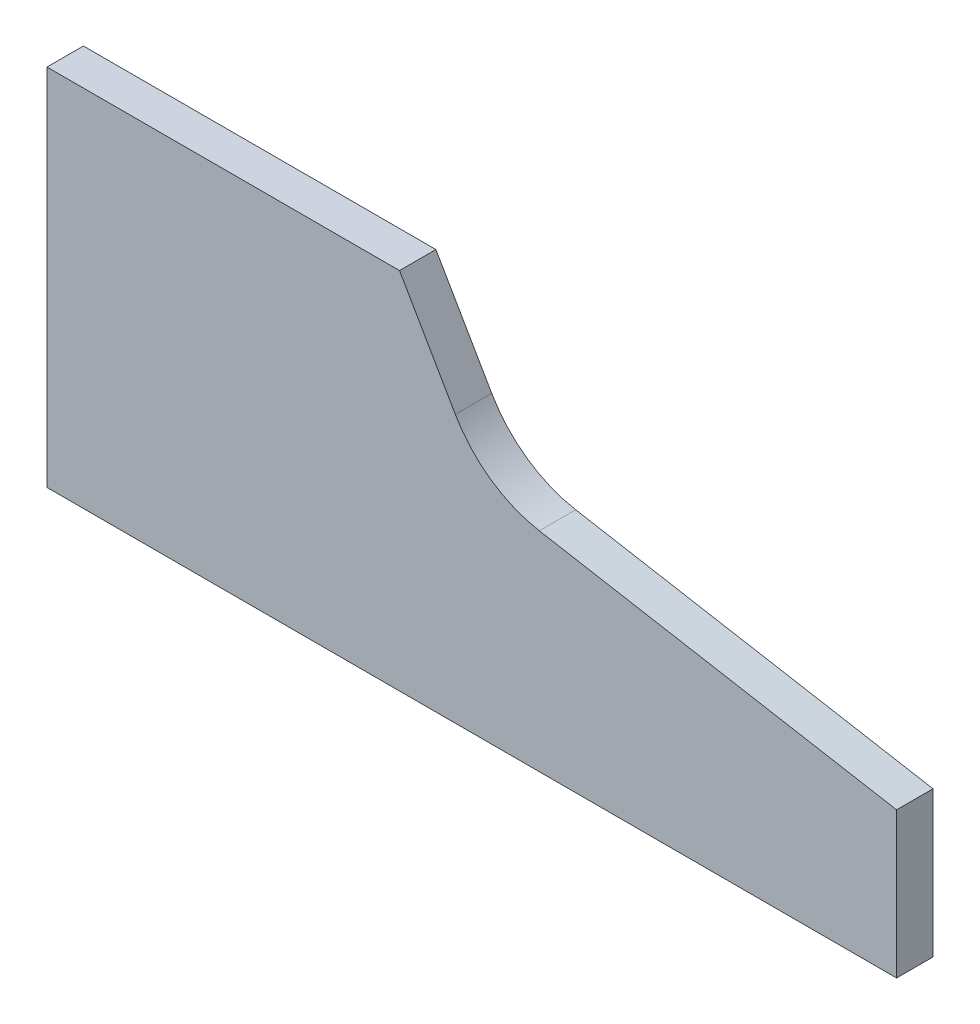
ISO-10303-21;
HEADER;
FILE_DESCRIPTION(('STEP AP214'),'2;1');
FILE_NAME('part.step','',(''),(''),'','','');
FILE_SCHEMA(('AUTOMOTIVE_DESIGN { 1 0 10303 214 1 1 1 1 }'));
ENDSEC;
DATA;
#1=APPLICATION_CONTEXT('core data for automotive mechanical design processes');
#2=APPLICATION_PROTOCOL_DEFINITION('international standard','automotive_design',2000,#1);
#3=PRODUCT_CONTEXT('',#1,'mechanical');
#4=PRODUCT('Part','Part','',(#3));
#5=PRODUCT_RELATED_PRODUCT_CATEGORY('part','',(#4));
#6=PRODUCT_DEFINITION_FORMATION('','',#4);
#7=PRODUCT_DEFINITION_CONTEXT('part definition',#1,'design');
#8=PRODUCT_DEFINITION('design','',#6,#7);
#9=PRODUCT_DEFINITION_SHAPE('','',#8);
#10=(LENGTH_UNIT() NAMED_UNIT(*) SI_UNIT(.MILLI.,.METRE.));
#11=(NAMED_UNIT(*) PLANE_ANGLE_UNIT() SI_UNIT($,.RADIAN.));
#12=(NAMED_UNIT(*) SI_UNIT($,.STERADIAN.) SOLID_ANGLE_UNIT());
#13=UNCERTAINTY_MEASURE_WITH_UNIT(LENGTH_MEASURE(1.E-05),#10,'distance_accuracy_value','');
#14=(GEOMETRIC_REPRESENTATION_CONTEXT(3) GLOBAL_UNCERTAINTY_ASSIGNED_CONTEXT((#13)) GLOBAL_UNIT_ASSIGNED_CONTEXT((#10,
#11,#12)) REPRESENTATION_CONTEXT('',''));
#15=CARTESIAN_POINT('',(0.,0.,0.));
#16=DIRECTION('',(0.,0.,1.));
#17=DIRECTION('',(1.,0.,0.));
#18=AXIS2_PLACEMENT_3D('',#15,#16,#17);
#19=CARTESIAN_POINT('',(70.,0.,1.5));
#20=DIRECTION('',(0.,1.,0.));
#21=DIRECTION('',(-1.,0.,0.));
#22=AXIS2_PLACEMENT_3D('',#19,#20,#21);
#23=PLANE('',#22);
#24=DIRECTION('',(1.,0.,0.));
#25=VECTOR('',#24,1.);
#26=CARTESIAN_POINT('',(70.,0.,-1.5));
#27=LINE('',#26,#25);
#28=CARTESIAN_POINT('',(0.,0.,-1.5));
#29=VERTEX_POINT('',#28);
#30=CARTESIAN_POINT('',(70.,0.,-1.5));
#31=VERTEX_POINT('',#30);
#32=EDGE_CURVE('E123',#29,#31,#27,.T.);
#33=ORIENTED_EDGE('',*,*,#32,.T.);
#34=DIRECTION('',(0.,0.,-1.));
#35=VECTOR('',#34,1.);
#36=CARTESIAN_POINT('',(70.,0.,1.5));
#37=LINE('',#36,#35);
#38=CARTESIAN_POINT('',(70.,0.,1.5));
#39=VERTEX_POINT('',#38);
#40=EDGE_CURVE('E11',#39,#31,#37,.T.);
#41=ORIENTED_EDGE('',*,*,#40,.F.);
#42=DIRECTION('',(1.,0.,0.));
#43=VECTOR('',#42,1.);
#44=CARTESIAN_POINT('',(70.,0.,1.5));
#45=LINE('',#44,#43);
#46=CARTESIAN_POINT('',(0.,0.,1.5));
#47=VERTEX_POINT('',#46);
#48=EDGE_CURVE('E135',#47,#39,#45,.T.);
#49=ORIENTED_EDGE('',*,*,#48,.F.);
#50=DIRECTION('',(0.,0.,-1.));
#51=VECTOR('',#50,1.);
#52=CARTESIAN_POINT('',(0.,0.,1.5));
#53=LINE('',#52,#51);
#54=EDGE_CURVE('E119',#47,#29,#53,.T.);
#55=ORIENTED_EDGE('',*,*,#54,.T.);
#56=EDGE_LOOP('',(#33,#41,#49,#55));
#57=FACE_BOUND('',#56,.T.);
#58=ADVANCED_FACE('F33',(#57),#23,.F.);
#59=CARTESIAN_POINT('',(70.,12.,1.5));
#60=DIRECTION('',(-1.,0.,0.));
#61=DIRECTION('',(0.,0.,1.));
#62=AXIS2_PLACEMENT_3D('',#59,#60,#61);
#63=PLANE('',#62);
#64=DIRECTION('',(0.,1.,0.));
#65=VECTOR('',#64,1.);
#66=CARTESIAN_POINT('',(70.,12.,-1.5));
#67=LINE('',#66,#65);
#68=CARTESIAN_POINT('',(70.,12.,-1.5));
#69=VERTEX_POINT('',#68);
#70=EDGE_CURVE('E126',#31,#69,#67,.T.);
#71=ORIENTED_EDGE('',*,*,#70,.T.);
#72=DIRECTION('',(0.,0.,-1.));
#73=VECTOR('',#72,1.);
#74=CARTESIAN_POINT('',(70.,12.,1.5));
#75=LINE('',#74,#73);
#76=CARTESIAN_POINT('',(70.,12.,1.5));
#77=VERTEX_POINT('',#76);
#78=EDGE_CURVE('E41',#77,#69,#75,.T.);
#79=ORIENTED_EDGE('',*,*,#78,.F.);
#80=DIRECTION('',(0.,1.,0.));
#81=VECTOR('',#80,1.);
#82=CARTESIAN_POINT('',(70.,12.,1.5));
#83=LINE('',#82,#81);
#84=EDGE_CURVE('E89',#39,#77,#83,.T.);
#85=ORIENTED_EDGE('',*,*,#84,.F.);
#86=ORIENTED_EDGE('',*,*,#40,.T.);
#87=EDGE_LOOP('',(#71,#79,#85,#86));
#88=FACE_BOUND('',#87,.T.);
#89=ADVANCED_FACE('F160',(#88),#63,.F.);
#90=CARTESIAN_POINT('',(40.5645430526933,17.1902652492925,1.5));
#91=DIRECTION('',(-0.173648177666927,-0.984807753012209,0.));
#92=DIRECTION('',(0.984807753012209,-0.173648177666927,0.));
#93=AXIS2_PLACEMENT_3D('',#90,#91,#92);
#94=PLANE('',#93);
#95=DIRECTION('',(-0.984807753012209,0.173648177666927,0.));
#96=VECTOR('',#95,1.);
#97=CARTESIAN_POINT('',(40.5645430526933,17.1902652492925,-1.5));
#98=LINE('',#97,#96);
#99=CARTESIAN_POINT('',(40.5645430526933,17.1902652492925,-1.5));
#100=VERTEX_POINT('',#99);
#101=EDGE_CURVE('E128',#69,#100,#98,.T.);
#102=ORIENTED_EDGE('',*,*,#101,.T.);
#103=DIRECTION('',(0.,0.,-1.));
#104=VECTOR('',#103,1.);
#105=CARTESIAN_POINT('',(40.5645430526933,17.1902652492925,1.5));
#106=LINE('',#105,#104);
#107=CARTESIAN_POINT('',(40.5645430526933,17.1902652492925,1.5));
#108=VERTEX_POINT('',#107);
#109=EDGE_CURVE('E139',#108,#100,#106,.T.);
#110=ORIENTED_EDGE('',*,*,#109,.F.);
#111=DIRECTION('',(-0.984807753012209,0.173648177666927,0.));
#112=VECTOR('',#111,1.);
#113=CARTESIAN_POINT('',(40.5645430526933,17.1902652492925,1.5));
#114=LINE('',#113,#112);
#115=EDGE_CURVE('E147',#77,#108,#114,.T.);
#116=ORIENTED_EDGE('',*,*,#115,.F.);
#117=ORIENTED_EDGE('',*,*,#78,.T.);
#118=EDGE_LOOP('',(#102,#110,#116,#117));
#119=FACE_BOUND('',#118,.T.);
#120=ADVANCED_FACE('F145',(#119),#94,.F.);
#121=CARTESIAN_POINT('',(42.3010248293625,27.0383427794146,1.5));
#122=DIRECTION('',(0.,0.,-1.));
#123=DIRECTION('',(-1.,0.,0.));
#124=AXIS2_PLACEMENT_3D('',#121,#122,#123);
#125=CYLINDRICAL_SURFACE('',#124,9.99999999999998);
#126=CARTESIAN_POINT('',(42.3010248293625,27.0383427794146,-1.5));
#127=DIRECTION('',(0.,0.,-1.));
#128=DIRECTION('',(-1.,0.,0.));
#129=AXIS2_PLACEMENT_3D('',#126,#127,#128);
#130=CIRCLE('',#129,9.99999999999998);
#131=CARTESIAN_POINT('',(33.6407707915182,22.0383427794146,-1.5));
#132=VERTEX_POINT('',#131);
#133=EDGE_CURVE('E130',#100,#132,#130,.T.);
#134=ORIENTED_EDGE('',*,*,#133,.T.);
#135=DIRECTION('',(0.,0.,-1.));
#136=VECTOR('',#135,1.);
#137=CARTESIAN_POINT('',(33.6407707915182,22.0383427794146,1.5));
#138=LINE('',#137,#136);
#139=CARTESIAN_POINT('',(33.6407707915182,22.0383427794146,1.5));
#140=VERTEX_POINT('',#139);
#141=EDGE_CURVE('E114',#140,#132,#138,.T.);
#142=ORIENTED_EDGE('',*,*,#141,.F.);
#143=CARTESIAN_POINT('',(42.3010248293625,27.0383427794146,1.5));
#144=DIRECTION('',(0.,0.,-1.));
#145=DIRECTION('',(-1.,0.,0.));
#146=AXIS2_PLACEMENT_3D('',#143,#144,#145);
#147=CIRCLE('',#146,9.99999999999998);
#148=EDGE_CURVE('E105',#108,#140,#147,.T.);
#149=ORIENTED_EDGE('',*,*,#148,.F.);
#150=ORIENTED_EDGE('',*,*,#109,.T.);
#151=EDGE_LOOP('',(#134,#142,#149,#150));
#152=FACE_BOUND('',#151,.T.);
#153=ADVANCED_FACE('F153',(#152),#125,.F.);
#154=CARTESIAN_POINT('',(29.0441058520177,30.,1.5));
#155=DIRECTION('',(-0.86602540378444,-0.499999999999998,0.));
#156=DIRECTION('',(0.499999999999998,-0.86602540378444,0.));
#157=AXIS2_PLACEMENT_3D('',#154,#155,#156);
#158=PLANE('',#157);
#159=DIRECTION('',(-0.499999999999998,0.86602540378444,0.));
#160=VECTOR('',#159,1.);
#161=CARTESIAN_POINT('',(29.0441058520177,30.,-1.5));
#162=LINE('',#161,#160);
#163=CARTESIAN_POINT('',(29.0441058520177,30.,-1.5));
#164=VERTEX_POINT('',#163);
#165=EDGE_CURVE('E113',#132,#164,#162,.T.);
#166=ORIENTED_EDGE('',*,*,#165,.T.);
#167=DIRECTION('',(0.,0.,-1.));
#168=VECTOR('',#167,1.);
#169=CARTESIAN_POINT('',(29.0441058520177,30.,1.5));
#170=LINE('',#169,#168);
#171=CARTESIAN_POINT('',(29.0441058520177,30.,1.5));
#172=VERTEX_POINT('',#171);
#173=EDGE_CURVE('E110',#172,#164,#170,.T.);
#174=ORIENTED_EDGE('',*,*,#173,.F.);
#175=DIRECTION('',(-0.499999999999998,0.86602540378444,0.));
#176=VECTOR('',#175,1.);
#177=CARTESIAN_POINT('',(29.0441058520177,30.,1.5));
#178=LINE('',#177,#176);
#179=EDGE_CURVE('E99',#140,#172,#178,.T.);
#180=ORIENTED_EDGE('',*,*,#179,.F.);
#181=ORIENTED_EDGE('',*,*,#141,.T.);
#182=EDGE_LOOP('',(#166,#174,#180,#181));
#183=FACE_BOUND('',#182,.T.);
#184=ADVANCED_FACE('F111',(#183),#158,.F.);
#185=CARTESIAN_POINT('',(0.,30.,1.5));
#186=DIRECTION('',(0.,-1.,0.));
#187=DIRECTION('',(0.,0.,-1.));
#188=AXIS2_PLACEMENT_3D('',#185,#186,#187);
#189=PLANE('',#188);
#190=DIRECTION('',(-1.,0.,0.));
#191=VECTOR('',#190,1.);
#192=CARTESIAN_POINT('',(0.,30.,-1.5));
#193=LINE('',#192,#191);
#194=CARTESIAN_POINT('',(0.,30.,-1.5));
#195=VERTEX_POINT('',#194);
#196=EDGE_CURVE('E75',#164,#195,#193,.T.);
#197=ORIENTED_EDGE('',*,*,#196,.T.);
#198=DIRECTION('',(0.,0.,-1.));
#199=VECTOR('',#198,1.);
#200=CARTESIAN_POINT('',(0.,30.,1.5));
#201=LINE('',#200,#199);
#202=CARTESIAN_POINT('',(0.,30.,1.5));
#203=VERTEX_POINT('',#202);
#204=EDGE_CURVE('E115',#203,#195,#201,.T.);
#205=ORIENTED_EDGE('',*,*,#204,.F.);
#206=DIRECTION('',(-1.,0.,0.));
#207=VECTOR('',#206,1.);
#208=CARTESIAN_POINT('',(0.,30.,1.5));
#209=LINE('',#208,#207);
#210=EDGE_CURVE('E103',#172,#203,#209,.T.);
#211=ORIENTED_EDGE('',*,*,#210,.F.);
#212=ORIENTED_EDGE('',*,*,#173,.T.);
#213=EDGE_LOOP('',(#197,#205,#211,#212));
#214=FACE_BOUND('',#213,.T.);
#215=ADVANCED_FACE('F117',(#214),#189,.F.);
#216=CARTESIAN_POINT('',(0.,0.,1.5));
#217=DIRECTION('',(1.,0.,0.));
#218=DIRECTION('',(0.,0.,-1.));
#219=AXIS2_PLACEMENT_3D('',#216,#217,#218);
#220=PLANE('',#219);
#221=DIRECTION('',(0.,-1.,0.));
#222=VECTOR('',#221,1.);
#223=CARTESIAN_POINT('',(0.,0.,-1.5));
#224=LINE('',#223,#222);
#225=EDGE_CURVE('E81',#195,#29,#224,.T.);
#226=ORIENTED_EDGE('',*,*,#225,.T.);
#227=ORIENTED_EDGE('',*,*,#54,.F.);
#228=DIRECTION('',(0.,-1.,0.));
#229=VECTOR('',#228,1.);
#230=CARTESIAN_POINT('',(0.,0.,1.5));
#231=LINE('',#230,#229);
#232=EDGE_CURVE('E49',#203,#47,#231,.T.);
#233=ORIENTED_EDGE('',*,*,#232,.F.);
#234=ORIENTED_EDGE('',*,*,#204,.T.);
#235=EDGE_LOOP('',(#226,#227,#233,#234));
#236=FACE_BOUND('',#235,.T.);
#237=ADVANCED_FACE('F174',(#236),#220,.F.);
#238=CARTESIAN_POINT('',(42.3010248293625,27.0383427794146,1.5));
#239=DIRECTION('',(0.,0.,-1.));
#240=DIRECTION('',(-1.,0.,0.));
#241=AXIS2_PLACEMENT_3D('',#238,#239,#240);
#242=PLANE('',#241);
#243=ORIENTED_EDGE('',*,*,#48,.T.);
#244=ORIENTED_EDGE('',*,*,#84,.T.);
#245=ORIENTED_EDGE('',*,*,#115,.T.);
#246=ORIENTED_EDGE('',*,*,#148,.T.);
#247=ORIENTED_EDGE('',*,*,#179,.T.);
#248=ORIENTED_EDGE('',*,*,#210,.T.);
#249=ORIENTED_EDGE('',*,*,#232,.T.);
#250=EDGE_LOOP('',(#243,#244,#245,#246,#247,#248,#249));
#251=FACE_BOUND('',#250,.T.);
#252=ADVANCED_FACE('F101',(#251),#242,.F.);
#253=CARTESIAN_POINT('',(42.3010248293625,27.0383427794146,-1.5));
#254=DIRECTION('',(0.,0.,-1.));
#255=DIRECTION('',(-1.,0.,0.));
#256=AXIS2_PLACEMENT_3D('',#253,#254,#255);
#257=PLANE('',#256);
#258=ORIENTED_EDGE('',*,*,#32,.F.);
#259=ORIENTED_EDGE('',*,*,#225,.F.);
#260=ORIENTED_EDGE('',*,*,#196,.F.);
#261=ORIENTED_EDGE('',*,*,#165,.F.);
#262=ORIENTED_EDGE('',*,*,#133,.F.);
#263=ORIENTED_EDGE('',*,*,#101,.F.);
#264=ORIENTED_EDGE('',*,*,#70,.F.);
#265=EDGE_LOOP('',(#258,#259,#260,#261,#262,#263,#264));
#266=FACE_BOUND('',#265,.T.);
#267=ADVANCED_FACE('F151',(#266),#257,.T.);
#268=CLOSED_SHELL('',(#58,#89,#120,#153,#184,#215,#237,#252,#267));
#269=MANIFOLD_SOLID_BREP('B2',#268);
#270=ADVANCED_BREP_SHAPE_REPRESENTATION('',(#18,#269),#14);
#271=SHAPE_DEFINITION_REPRESENTATION(#9,#270);
ENDSEC;
END-ISO-10303-21;
